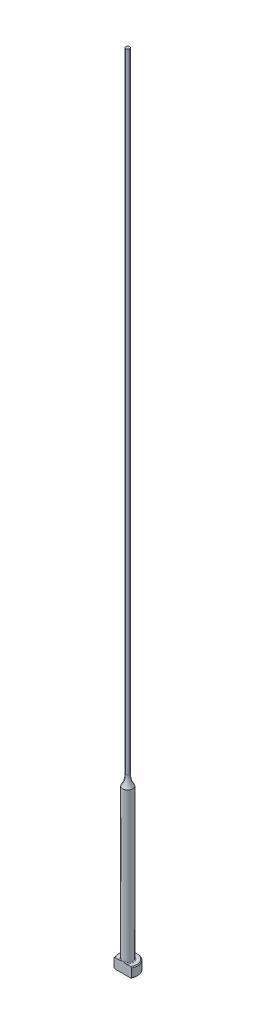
from build123d import *

# Parameters (mm, degrees)
CHAMFER1_SIZE = 0.254
FILLET1_R     = 0.254
KEY_DEPTH     = 255.0396844


with BuildPart() as part:
    # Sketch1 → Revolve1 (revolve)
    with BuildSketch(Plane.XY, mode=Mode.PRIVATE) as revolve1_sk:
        with BuildLine():
            Line((0, 0), (-3.175, 0))
            Line((-3.175, 0), (-3.175, 3.175))
            Line((-3.175, 3.175), (-1.5875, 3.175))
            Line((-1.5875, 3.175), (-1.5875, 50.8))
            ThreePointArc((-1.5875, 50.8), (-0.847698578, 52.434042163), (-0.59436, 54.209772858))
            Line((-0.59436, 54.209772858), (-0.59436, 254))
            Line((-0.59436, 254), (0, 254))
            Line((0, 254), (0, 0))
        make_face()
    revolve(revolve1_sk.sketch.rotate(Axis((0, 259.958771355, 0), (0, -1, 0)), 270), axis=Axis((0, 259.958771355, 0), (0, -1, 0)))

    # Chamfer1
    chamfer1_edges = [part.edges().sort_by_distance(p)[0] for p in [
        (0, 0, -3.175),
        (0, 3.175, -3.175),
    ]]
    chamfer(chamfer1_edges, length=CHAMFER1_SIZE)

    # Fillet1
    fillet1_edges = [part.edges().sort_by_distance(p)[0] for p in [
        (0, 3.175, -1.5875),
    ]]
    fillet(fillet1_edges, radius=FILLET1_R)

    # Sketch2 → KEY (cut, through all)
    with BuildSketch(Plane.XZ):
        with BuildLine():
            Line((-2.749630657, 1.5875), (2.749630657, 1.5875))
            ThreePointArc((2.749630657, 1.5875), (0, 3.175), (-2.749630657, 1.5875))
        make_face()
    extrude(amount=-KEY_DEPTH, mode=Mode.SUBTRACT)


solid = part.part
